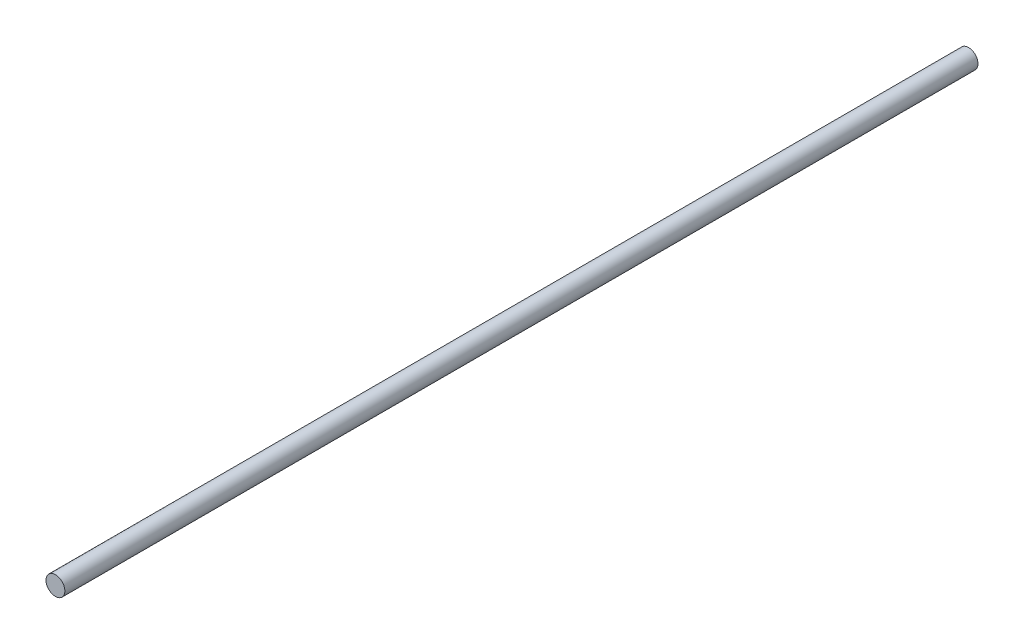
ISO-10303-21;
HEADER;
FILE_DESCRIPTION(('STEP AP214'),'2;1');
FILE_NAME('part.step','',(''),(''),'','','');
FILE_SCHEMA(('AUTOMOTIVE_DESIGN { 1 0 10303 214 1 1 1 1 }'));
ENDSEC;
DATA;
#1=APPLICATION_CONTEXT('core data for automotive mechanical design processes');
#2=APPLICATION_PROTOCOL_DEFINITION('international standard','automotive_design',2000,#1);
#3=PRODUCT_CONTEXT('',#1,'mechanical');
#4=PRODUCT('Part','Part','',(#3));
#5=PRODUCT_RELATED_PRODUCT_CATEGORY('part','',(#4));
#6=PRODUCT_DEFINITION_FORMATION('','',#4);
#7=PRODUCT_DEFINITION_CONTEXT('part definition',#1,'design');
#8=PRODUCT_DEFINITION('design','',#6,#7);
#9=PRODUCT_DEFINITION_SHAPE('','',#8);
#10=(LENGTH_UNIT() NAMED_UNIT(*) SI_UNIT(.MILLI.,.METRE.));
#11=(NAMED_UNIT(*) PLANE_ANGLE_UNIT() SI_UNIT($,.RADIAN.));
#12=(NAMED_UNIT(*) SI_UNIT($,.STERADIAN.) SOLID_ANGLE_UNIT());
#13=UNCERTAINTY_MEASURE_WITH_UNIT(LENGTH_MEASURE(1.E-05),#10,'distance_accuracy_value','');
#14=(GEOMETRIC_REPRESENTATION_CONTEXT(3) GLOBAL_UNCERTAINTY_ASSIGNED_CONTEXT((#13)) GLOBAL_UNIT_ASSIGNED_CONTEXT((#10,
#11,#12)) REPRESENTATION_CONTEXT('',''));
#15=CARTESIAN_POINT('',(0.,0.,0.));
#16=DIRECTION('',(0.,0.,1.));
#17=DIRECTION('',(1.,0.,0.));
#18=AXIS2_PLACEMENT_3D('',#15,#16,#17);
#19=CARTESIAN_POINT('',(0.,0.,-2900.));
#20=DIRECTION('',(0.,0.,1.));
#21=DIRECTION('',(1.,0.,0.));
#22=AXIS2_PLACEMENT_3D('',#19,#20,#21);
#23=CYLINDRICAL_SURFACE('',#22,30.);
#24=CARTESIAN_POINT('',(0.,0.,-2900.));
#25=DIRECTION('',(0.,0.,1.));
#26=DIRECTION('',(1.,0.,0.));
#27=AXIS2_PLACEMENT_3D('',#24,#25,#26);
#28=CIRCLE('',#27,30.);
#29=CARTESIAN_POINT('',(30.,0.,-2900.));
#30=VERTEX_POINT('',#29);
#31=EDGE_CURVE('E10',#30,#30,#28,.T.);
#32=ORIENTED_EDGE('',*,*,#31,.T.);
#33=EDGE_LOOP('',(#32));
#34=FACE_BOUND('',#33,.T.);
#35=CARTESIAN_POINT('',(0.,0.,0.));
#36=DIRECTION('',(0.,0.,1.));
#37=DIRECTION('',(1.,0.,0.));
#38=AXIS2_PLACEMENT_3D('',#35,#36,#37);
#39=CIRCLE('',#38,30.);
#40=CARTESIAN_POINT('',(30.,0.,0.));
#41=VERTEX_POINT('',#40);
#42=EDGE_CURVE('E40',#41,#41,#39,.T.);
#43=ORIENTED_EDGE('',*,*,#42,.F.);
#44=EDGE_LOOP('',(#43));
#45=FACE_BOUND('',#44,.T.);
#46=ADVANCED_FACE('F37',(#34,#45),#23,.T.);
#47=CARTESIAN_POINT('',(0.,0.,-2900.));
#48=DIRECTION('',(0.,0.,1.));
#49=DIRECTION('',(1.,0.,0.));
#50=AXIS2_PLACEMENT_3D('',#47,#48,#49);
#51=PLANE('',#50);
#52=ORIENTED_EDGE('',*,*,#31,.F.);
#53=EDGE_LOOP('',(#52));
#54=FACE_BOUND('',#53,.T.);
#55=ADVANCED_FACE('F54',(#54),#51,.F.);
#56=CARTESIAN_POINT('',(0.,0.,0.));
#57=DIRECTION('',(0.,0.,1.));
#58=DIRECTION('',(1.,0.,0.));
#59=AXIS2_PLACEMENT_3D('',#56,#57,#58);
#60=PLANE('',#59);
#61=ORIENTED_EDGE('',*,*,#42,.T.);
#62=EDGE_LOOP('',(#61));
#63=FACE_BOUND('',#62,.T.);
#64=ADVANCED_FACE('F51',(#63),#60,.T.);
#65=CLOSED_SHELL('',(#46,#55,#64));
#66=MANIFOLD_SOLID_BREP('B2',#65);
#67=ADVANCED_BREP_SHAPE_REPRESENTATION('',(#18,#66),#14);
#68=SHAPE_DEFINITION_REPRESENTATION(#9,#67);
ENDSEC;
END-ISO-10303-21;
